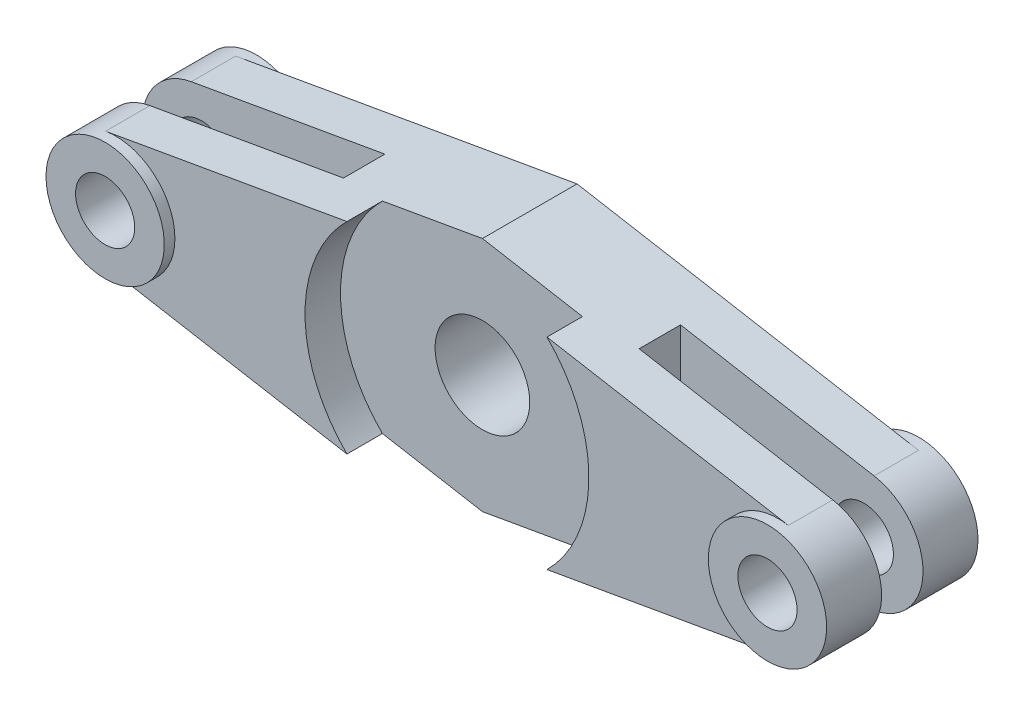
from build123d import *
from build123d.topology import SkipClean

# Parameters (mm, degrees)
ESQUISSE1_R             = 2.5
BASE_EXTRUSION_DEPTH    = 5.5
ESQUISSE2_R             = 5
ESQUISSE2_R_2           = 2.5
BOSS_EXTRU_1_DEPTH      = 0.9
ENL_V_MAT_EXTRU_1_DEPTH = 1.75
ESQUISSE4_R             = 12
ENL_V_MAT_EXTRU_2_DEPTH = 3
ESQUISSE5_R             = 4
ENL_V_MAT_EXTRU_3_DEPTH = 36.611936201


with BuildPart() as part:
    # Esquisse1 → Base-Extrusion (new, symmetric)
    with BuildSketch(Plane.XY):
        with BuildLine():
            Line((0, 10), (28.865876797, 4.924455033))
            ThreePointArc((28.865876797, 4.924455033), (33, 0), (28.865876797, -4.924455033))
            Line((28.865876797, -4.924455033), (0, -10))
            Line((0, -10), (-28.865876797, -4.924455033))
            ThreePointArc((-28.865876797, -4.924455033), (-33, 0), (-28.865876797, 4.924455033))
            Line((-28.865876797, 4.924455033), (0, 10))
        make_face()
        with Locations(Location((28, 0, 0), (0, 0, 180))):
            Circle(ESQUISSE1_R, mode=Mode.SUBTRACT)
        with Locations(Location((-28, 0, 0), (0, 0, 180))):
            Circle(ESQUISSE1_R, mode=Mode.SUBTRACT)
    extrude(amount=BASE_EXTRUSION_DEPTH, both=True)

    # Esquisse2 → Boss.-Extru.1 (add)
    # profile 1 of 2: a face of its own
    with BuildSketch(Plane.XY.offset(5.5)):
        with Locations(Location((28, 0, 0), (0, 0, 80.027507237))):
            Circle(ESQUISSE2_R)
        with Locations(Location((28, 0, 0), (0, 0, 180))):
            Circle(ESQUISSE2_R_2, mode=Mode.SUBTRACT)
    # profile 2 of 2: a face of its own
    with BuildSketch(Plane.XY.offset(5.5)):
        with Locations(Location((-28, 0, 0), (0, 0, 180))):
            Circle(ESQUISSE2_R)
        with Locations(Location((-28, 0, 0), (0, 0, 180))):
            Circle(ESQUISSE2_R_2, mode=Mode.SUBTRACT)
    boss_extru_1 = extrude(amount=BOSS_EXTRU_1_DEPTH)

    # Sym_trie1: Boss.-Extru.1 across plane
    with SkipClean():  # the faces are left unmerged after this step: merging them gives an invalid solid
        add(boss_extru_1.mirror(Plane.XY))

    # Esquisse3 → Enl_v. mat.-Extru.1 (cut, symmetric)
    with SkipClean():  # the faces are left unmerged after this step: merging them gives an invalid solid
        with BuildSketch(Plane.XY):
            Polygon((12.5, 11.308016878), (12.5, -12.489451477), (35.82278481, -12.489451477), (35.82278481, 0), (35.82278481, 11.308016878), align=None)
        enl_v_mat_extru_1 = extrude(amount=ENL_V_MAT_EXTRU_1_DEPTH, both=True, mode=Mode.SUBTRACT)

    # Sym_trie2: Enl_v. mat.-Extru.1 across plane
    add(enl_v_mat_extru_1.mirror(Plane(origin=(0, 0, 0), x_dir=(0, 0, 1), z_dir=(1, 0, 0))), mode=Mode.SUBTRACT)

    # Esquisse4 → Enl_v. mat.-Extru.2 (cut)
    with SkipClean():  # the faces are left unmerged after this step: merging them gives an invalid solid
        with BuildSketch(Plane.XY.offset(5.5)):
            Circle(ESQUISSE4_R)
        extrude(amount=-ENL_V_MAT_EXTRU_2_DEPTH, mode=Mode.SUBTRACT)

    # Esquisse5 → Enl_v. mat.-Extru.3 (cut, through all)
    with SkipClean():  # the faces are left unmerged after this step: merging them gives an invalid solid
        with BuildSketch(Plane.XY.offset(2.5)):
            Circle(ESQUISSE5_R)
        extrude(amount=-ENL_V_MAT_EXTRU_3_DEPTH, mode=Mode.SUBTRACT)


solid = part.part
